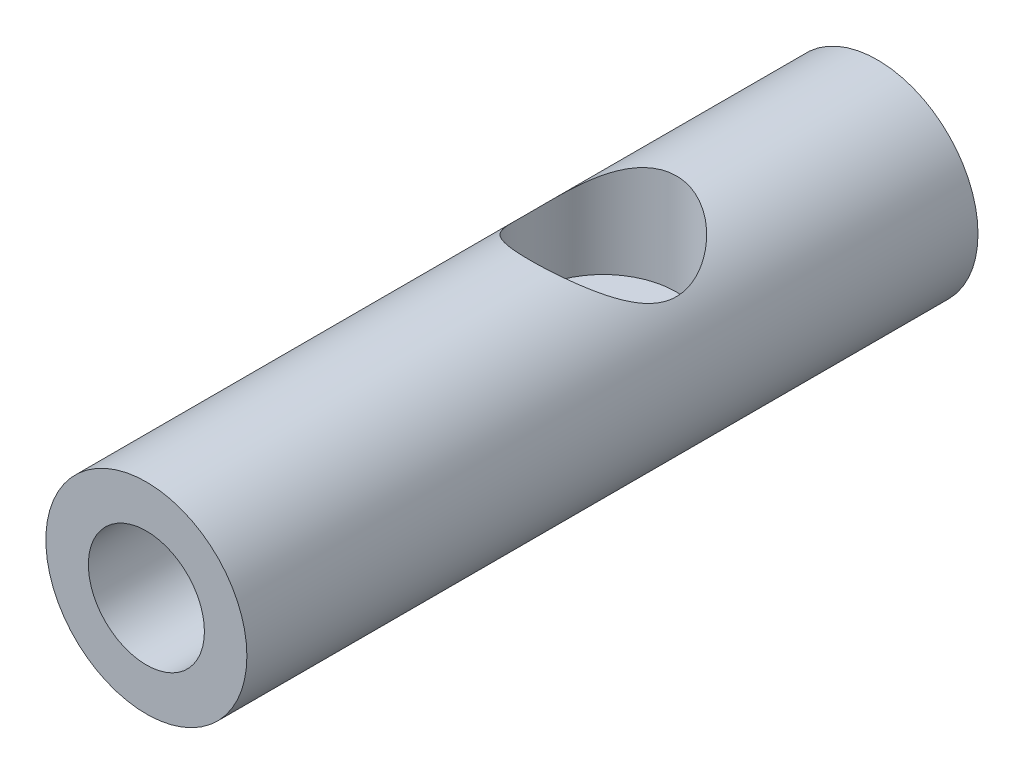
ISO-10303-21;
HEADER;
FILE_DESCRIPTION(('STEP AP214'),'2;1');
FILE_NAME('part.step','',(''),(''),'','','');
FILE_SCHEMA(('AUTOMOTIVE_DESIGN { 1 0 10303 214 1 1 1 1 }'));
ENDSEC;
DATA;
#1=APPLICATION_CONTEXT('core data for automotive mechanical design processes');
#2=APPLICATION_PROTOCOL_DEFINITION('international standard','automotive_design',2000,#1);
#3=PRODUCT_CONTEXT('',#1,'mechanical');
#4=PRODUCT('Part','Part','',(#3));
#5=PRODUCT_RELATED_PRODUCT_CATEGORY('part','',(#4));
#6=PRODUCT_DEFINITION_FORMATION('','',#4);
#7=PRODUCT_DEFINITION_CONTEXT('part definition',#1,'design');
#8=PRODUCT_DEFINITION('design','',#6,#7);
#9=PRODUCT_DEFINITION_SHAPE('','',#8);
#10=(LENGTH_UNIT() NAMED_UNIT(*) SI_UNIT(.MILLI.,.METRE.));
#11=(NAMED_UNIT(*) PLANE_ANGLE_UNIT() SI_UNIT($,.RADIAN.));
#12=(NAMED_UNIT(*) SI_UNIT($,.STERADIAN.) SOLID_ANGLE_UNIT());
#13=UNCERTAINTY_MEASURE_WITH_UNIT(LENGTH_MEASURE(1.E-05),#10,'distance_accuracy_value','');
#14=(GEOMETRIC_REPRESENTATION_CONTEXT(3) GLOBAL_UNCERTAINTY_ASSIGNED_CONTEXT((#13)) GLOBAL_UNIT_ASSIGNED_CONTEXT((#10,
#11,#12)) REPRESENTATION_CONTEXT('',''));
#15=CARTESIAN_POINT('',(0.,0.,0.));
#16=DIRECTION('',(0.,0.,1.));
#17=DIRECTION('',(1.,0.,0.));
#18=AXIS2_PLACEMENT_3D('',#15,#16,#17);
#19=CARTESIAN_POINT('',(0.,0.,20.));
#20=DIRECTION('',(0.,0.,-1.));
#21=DIRECTION('',(-1.,0.,0.));
#22=AXIS2_PLACEMENT_3D('',#19,#20,#21);
#23=CYLINDRICAL_SURFACE('',#22,5.5);
#24=CARTESIAN_POINT('',(0.,0.,20.));
#25=DIRECTION('',(0.,0.,1.));
#26=DIRECTION('',(1.,0.,0.));
#27=AXIS2_PLACEMENT_3D('',#24,#25,#26);
#28=CIRCLE('',#27,5.5);
#29=CARTESIAN_POINT('',(5.5,0.,20.));
#30=VERTEX_POINT('',#29);
#31=EDGE_CURVE('E42',#30,#30,#28,.T.);
#32=ORIENTED_EDGE('',*,*,#31,.F.);
#33=EDGE_LOOP('',(#32));
#34=FACE_BOUND('',#33,.T.);
#35=CARTESIAN_POINT('',(0.,0.,-20.));
#36=DIRECTION('',(0.,0.,1.));
#37=DIRECTION('',(1.,0.,0.));
#38=AXIS2_PLACEMENT_3D('',#35,#36,#37);
#39=CIRCLE('',#38,5.5);
#40=CARTESIAN_POINT('',(5.5,0.,-20.));
#41=VERTEX_POINT('',#40);
#42=EDGE_CURVE('E46',#41,#41,#39,.T.);
#43=ORIENTED_EDGE('',*,*,#42,.T.);
#44=EDGE_LOOP('',(#43));
#45=FACE_BOUND('',#44,.T.);
#46=CARTESIAN_POINT('',(0.,5.5,-9.));
#47=CARTESIAN_POINT('',(-0.098408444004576,5.49999903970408,-8.99999899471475));
#48=CARTESIAN_POINT('',(-0.196846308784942,5.49735205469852,-8.99636152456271));
#49=CARTESIAN_POINT('',(-0.392949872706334,5.48682476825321,-8.98186763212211));
#50=CARTESIAN_POINT('',(-0.490615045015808,5.47894116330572,-8.97100665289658));
#51=CARTESIAN_POINT('',(-0.684555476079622,5.45810479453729,-8.94220851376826));
#52=CARTESIAN_POINT('',(-0.780827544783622,5.44514186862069,-8.92425716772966));
#53=CARTESIAN_POINT('',(-0.971092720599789,5.41445183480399,-8.88155959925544));
#54=CARTESIAN_POINT('',(-1.0650847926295,5.39672260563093,-8.85681035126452));
#55=CARTESIAN_POINT('',(-1.34149727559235,5.33719436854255,-8.77322101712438));
#56=CARTESIAN_POINT('',(-1.51974308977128,5.28889729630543,-8.70482639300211));
#57=CARTESIAN_POINT('',(-1.86104833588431,5.17868357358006,-8.54570801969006));
#58=CARTESIAN_POINT('',(-2.02411279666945,5.11677145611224,-8.45499170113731));
#59=CARTESIAN_POINT('',(-2.34745196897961,4.97726899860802,-8.24498611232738));
#60=CARTESIAN_POINT('',(-2.50612448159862,4.89876490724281,-8.12384867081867));
#61=CARTESIAN_POINT('',(-2.80234464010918,4.735556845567,-7.86114554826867));
#62=CARTESIAN_POINT('',(-2.93985815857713,4.65084317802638,-7.71954756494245));
#63=CARTESIAN_POINT('',(-3.14142944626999,4.51549142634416,-7.47894022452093));
#64=CARTESIAN_POINT('',(-3.21271520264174,4.46491683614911,-7.38584323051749));
#65=CARTESIAN_POINT('',(-3.34716368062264,4.36503158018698,-7.1932384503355));
#66=CARTESIAN_POINT('',(-3.41032409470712,4.31572127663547,-7.09372885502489));
#67=CARTESIAN_POINT('',(-3.52805237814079,4.22002309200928,-6.8885986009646));
#68=CARTESIAN_POINT('',(-3.58263175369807,4.17363134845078,-6.78298638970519));
#69=CARTESIAN_POINT('',(-3.68277103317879,4.08554066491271,-6.56573311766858));
#70=CARTESIAN_POINT('',(-3.72833246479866,4.04384093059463,-6.45409308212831));
#71=CARTESIAN_POINT('',(-3.82361059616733,3.95419172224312,-6.18594942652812));
#72=CARTESIAN_POINT('',(-3.86948259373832,3.90893007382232,-6.02708689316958));
#73=CARTESIAN_POINT('',(-3.92354368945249,3.85440723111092,-5.78279639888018));
#74=CARTESIAN_POINT('',(-3.93910176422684,3.83846627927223,-5.70041335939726));
#75=CARTESIAN_POINT('',(-3.96508247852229,3.81162335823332,-5.53403852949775));
#76=CARTESIAN_POINT('',(-3.97550720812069,3.80071933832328,-5.45004740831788));
#77=CARTESIAN_POINT('',(-3.99107685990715,3.78436723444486,-5.28038994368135));
#78=CARTESIAN_POINT('',(-3.99618070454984,3.77896160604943,-5.19471569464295));
#79=CARTESIAN_POINT('',(-4.00085496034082,3.77401268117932,-5.02304696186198));
#80=CARTESIAN_POINT('',(-4.00042557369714,3.7744691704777,-4.93705248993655));
#81=CARTESIAN_POINT('',(-3.9940415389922,3.78122375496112,-4.7654654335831));
#82=CARTESIAN_POINT('',(-3.98808451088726,3.78752436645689,-4.67987303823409));
#83=CARTESIAN_POINT('',(-3.97077015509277,3.80567208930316,-4.50979837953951));
#84=CARTESIAN_POINT('',(-3.95941003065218,3.81752207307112,-4.42531671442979));
#85=CARTESIAN_POINT('',(-3.9299073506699,3.847898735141,-4.24849885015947));
#86=CARTESIAN_POINT('',(-3.91113665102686,3.86703500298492,-4.15637223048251));
#87=CARTESIAN_POINT('',(-3.86752833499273,3.91064916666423,-3.97483911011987));
#88=CARTESIAN_POINT('',(-3.84268664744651,3.93513064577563,-3.8854344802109));
#89=CARTESIAN_POINT('',(-3.75954096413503,4.01518937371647,-3.62164748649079));
#90=CARTESIAN_POINT('',(-3.69264874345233,4.07734524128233,-3.45187919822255));
#91=CARTESIAN_POINT('',(-3.5642123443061,4.18940076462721,-3.18040877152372));
#92=CARTESIAN_POINT('',(-3.50823146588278,4.23654386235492,-3.07478209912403));
#93=CARTESIAN_POINT('',(-3.38767435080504,4.33354849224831,-2.86979154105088));
#94=CARTESIAN_POINT('',(-3.32309579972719,4.38341075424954,-2.77042935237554));
#95=CARTESIAN_POINT('',(-3.18565928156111,4.48428947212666,-2.57810772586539));
#96=CARTESIAN_POINT('',(-3.11279435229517,4.53530686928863,-2.48515377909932));
#97=CARTESIAN_POINT('',(-2.95905843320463,4.63707579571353,-2.30594962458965));
#98=CARTESIAN_POINT('',(-2.87818712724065,4.68782731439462,-2.21969968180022));
#99=CARTESIAN_POINT('',(-2.70755212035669,4.78843347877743,-2.05321386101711));
#100=CARTESIAN_POINT('',(-2.61768838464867,4.83826850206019,-1.9730684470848));
#101=CARTESIAN_POINT('',(-2.43017835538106,4.93511583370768,-1.82056052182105));
#102=CARTESIAN_POINT('',(-2.33253311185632,4.98212852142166,-1.74819696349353));
#103=CARTESIAN_POINT('',(-2.12992764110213,5.07204693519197,-1.61204068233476));
#104=CARTESIAN_POINT('',(-2.02498109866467,5.11496000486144,-1.54823254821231));
#105=CARTESIAN_POINT('',(-1.8081616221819,5.19556941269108,-1.42987191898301));
#106=CARTESIAN_POINT('',(-1.69629131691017,5.23326771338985,-1.37531594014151));
#107=CARTESIAN_POINT('',(-1.4102171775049,5.31912327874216,-1.25221715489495));
#108=CARTESIAN_POINT('',(-1.2321446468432,5.36345823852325,-1.18976440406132));
#109=CARTESIAN_POINT('',(-0.865776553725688,5.43463079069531,-1.09021443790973));
#110=CARTESIAN_POINT('',(-0.677488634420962,5.46148127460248,-1.05309854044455));
#111=CARTESIAN_POINT('',(-0.295007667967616,5.4954458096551,-1.00623075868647));
#112=CARTESIAN_POINT('',(-0.100795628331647,5.50248769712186,-0.996578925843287));
#113=CARTESIAN_POINT('',(0.28662144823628,5.49594258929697,-1.00557956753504));
#114=CARTESIAN_POINT('',(0.479826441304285,5.48235470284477,-1.02423326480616));
#115=CARTESIAN_POINT('',(0.84845487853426,5.43715890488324,-1.08680099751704));
#116=CARTESIAN_POINT('',(1.02426702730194,5.40660857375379,-1.12923377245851));
#117=CARTESIAN_POINT('',(1.36562564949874,5.33063562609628,-1.23608136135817));
#118=CARTESIAN_POINT('',(1.53116998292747,5.28520992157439,-1.30050073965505));
#119=CARTESIAN_POINT('',(1.86254817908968,5.17819647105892,-1.45499135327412));
#120=CARTESIAN_POINT('',(2.02725211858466,5.11557595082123,-1.54675530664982));
#121=CARTESIAN_POINT('',(2.33947109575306,4.98054847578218,-1.75013135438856));
#122=CARTESIAN_POINT('',(2.48697454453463,4.90813499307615,-1.86175670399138));
#123=CARTESIAN_POINT('',(2.78904311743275,4.74403863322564,-2.12452792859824));
#124=CARTESIAN_POINT('',(2.9399691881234,4.65125321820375,-2.27916807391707));
#125=CARTESIAN_POINT('',(3.2152051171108,4.46542541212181,-2.61066271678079));
#126=CARTESIAN_POINT('',(3.33949353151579,4.37238287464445,-2.78753493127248));
#127=CARTESIAN_POINT('',(3.54628148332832,4.20586816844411,-3.13977727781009));
#128=CARTESIAN_POINT('',(3.63201008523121,4.13138834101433,-3.31276640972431));
#129=CARTESIAN_POINT('',(3.77892413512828,3.99745252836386,-3.67425257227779));
#130=CARTESIAN_POINT('',(3.84016090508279,3.93796522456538,-3.86271616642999));
#131=CARTESIAN_POINT('',(3.92447442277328,3.85373689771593,-4.21054640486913));
#132=CARTESIAN_POINT('',(3.95293016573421,3.82427115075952,-4.36743397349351));
#133=CARTESIAN_POINT('',(3.99085072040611,3.78469363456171,-4.68581080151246));
#134=CARTESIAN_POINT('',(4.00034270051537,3.77455417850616,-4.84729314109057));
#135=CARTESIAN_POINT('',(3.9996377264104,3.77530099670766,-5.17040511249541));
#136=CARTESIAN_POINT('',(3.98941138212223,3.786218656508,-5.33203460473));
#137=CARTESIAN_POINT('',(3.95001664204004,3.82728792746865,-5.65055529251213));
#138=CARTESIAN_POINT('',(3.92081835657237,3.85746988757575,-5.80743860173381));
#139=CARTESIAN_POINT('',(3.83369579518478,3.94430870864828,-6.15974890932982));
#140=CARTESIAN_POINT('',(3.76972865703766,4.00623096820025,-6.35235018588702));
#141=CARTESIAN_POINT('',(3.61630704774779,4.14523984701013,-6.72116198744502));
#142=CARTESIAN_POINT('',(3.5268095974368,4.2223519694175,-6.89734420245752));
#143=CARTESIAN_POINT('',(3.32181769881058,4.38556998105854,-7.23742741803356));
#144=CARTESIAN_POINT('',(3.20563731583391,4.47187341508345,-7.4008161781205));
#145=CARTESIAN_POINT('',(2.95012732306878,4.64440662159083,-7.70864188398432));
#146=CARTESIAN_POINT('',(2.81078817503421,4.73063634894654,-7.85307097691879));
#147=CARTESIAN_POINT('',(2.56887263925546,4.86434742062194,-8.06853788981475));
#148=CARTESIAN_POINT('',(2.47320695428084,4.91380339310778,-8.1462007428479));
#149=CARTESIAN_POINT('',(2.27388986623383,5.00915341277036,-8.29313709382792));
#150=CARTESIAN_POINT('',(2.17023667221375,5.05504665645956,-8.3624087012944));
#151=CARTESIAN_POINT('',(1.95549931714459,5.14192851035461,-8.49166326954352));
#152=CARTESIAN_POINT('',(1.84442265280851,5.18292195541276,-8.55165540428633));
#153=CARTESIAN_POINT('',(1.61540436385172,5.25880189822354,-8.66149903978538));
#154=CARTESIAN_POINT('',(1.49746635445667,5.29369157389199,-8.71135581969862));
#155=CARTESIAN_POINT('',(1.29007572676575,5.34730754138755,-8.78737372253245));
#156=CARTESIAN_POINT('',(1.20206275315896,5.36780854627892,-8.81624110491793));
#157=CARTESIAN_POINT('',(1.02345557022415,5.40470593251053,-8.86796791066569));
#158=CARTESIAN_POINT('',(0.932861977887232,5.42110328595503,-8.89082875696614));
#159=CARTESIAN_POINT('',(0.749865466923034,5.44942698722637,-8.93019600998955));
#160=CARTESIAN_POINT('',(0.65746776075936,5.46136464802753,-8.94671849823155));
#161=CARTESIAN_POINT('',(0.471295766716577,5.48056812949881,-8.97324948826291));
#162=CARTESIAN_POINT('',(0.377522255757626,5.48783649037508,-8.98326153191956));
#163=CARTESIAN_POINT('',(0.236296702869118,5.49512453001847,-8.9932941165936));
#164=CARTESIAN_POINT('',(0.189097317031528,5.49695146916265,-8.99580740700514));
#165=CARTESIAN_POINT('',(0.0946008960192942,5.4993895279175,-8.99916071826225));
#166=CARTESIAN_POINT('',(0.0473038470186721,5.50000046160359,-9.00000048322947));
#167=CARTESIAN_POINT('',(0.,5.5,-9.));
#168=B_SPLINE_CURVE_WITH_KNOTS('',3,(#46,#47,#48,#49,#50,#51,#52,#53,#54,#55,#56,#57,#58,#59,
#60,#61,#62,#63,#64,#65,#66,#67,#68,#69,#70,#71,#72,#73,#74,#75,#76,#77,#78,#79,#80,#81,#82,#83,
#84,#85,#86,#87,#88,#89,#90,#91,#92,#93,#94,#95,#96,#97,#98,#99,#100,#101,#102,#103,#104,#105,
#106,#107,#108,#109,#110,#111,#112,#113,#114,#115,#116,#117,#118,#119,#120,#121,#122,#123,#124,
#125,#126,#127,#128,#129,#130,#131,#132,#133,#134,#135,#136,#137,#138,#139,#140,#141,#142,#143,
#144,#145,#146,#147,#148,#149,#150,#151,#152,#153,#154,#155,#156,#157,#158,#159,#160,#161,#162,
#163,#164,#165,#166,#167),.UNSPECIFIED.,.T.,.F.,(4,2,2,2,2,2,2,2,2,2,2,2,2,2,2,2,2,2,2,2,2,2,2,
2,2,2,2,2,2,2,2,2,2,2,2,2,2,2,2,2,2,2,2,2,2,2,2,2,2,2,2,2,2,2,2,2,2,2,2,2,4),(0.,
0.295173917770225,0.590534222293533,0.886488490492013,1.18257469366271,1.77055979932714,
2.35834943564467,2.99959161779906,3.64185745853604,4.02458431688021,4.40741962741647,
4.78973713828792,5.1719898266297,5.68407429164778,5.9398376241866,6.19549673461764,
6.45311525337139,6.71072435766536,6.96844443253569,7.22629805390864,7.51370613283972,
7.80130747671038,8.37708279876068,8.76220665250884,9.14743438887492,9.53298821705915,
9.91855727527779,10.3090312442,10.6994526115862,11.0891609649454,11.4787222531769,
12.0576277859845,12.6361059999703,13.2166889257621,13.7972969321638,14.3452171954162,
14.8932512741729,15.4870438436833,16.0812341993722,16.7840549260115,17.4874393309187,
18.1061725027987,18.7236022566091,19.2080094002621,19.6917220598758,20.1761562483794,
20.6613555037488,21.2944341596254,21.9285849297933,22.5813485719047,23.2343817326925,
23.6322360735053,24.0301798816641,24.4277277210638,24.8250679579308,25.1093874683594,
25.3936395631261,25.6771656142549,25.9605372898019,26.1024024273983,26.244289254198),.UNSPECIFIED.);
#169=CARTESIAN_POINT('',(0.,5.5,-9.));
#170=VERTEX_POINT('',#169);
#171=EDGE_CURVE('E10',#170,#170,#168,.T.);
#172=ORIENTED_EDGE('',*,*,#171,.F.);
#173=EDGE_LOOP('',(#172));
#174=FACE_BOUND('',#173,.T.);
#175=ADVANCED_FACE('F31',(#34,#45,#174),#23,.T.);
#176=CARTESIAN_POINT('',(0.,0.,20.));
#177=DIRECTION('',(0.,0.,1.));
#178=DIRECTION('',(1.,0.,0.));
#179=AXIS2_PLACEMENT_3D('',#176,#177,#178);
#180=PLANE('',#179);
#181=CARTESIAN_POINT('',(0.,0.,20.));
#182=DIRECTION('',(0.,0.,1.));
#183=DIRECTION('',(1.,0.,0.));
#184=AXIS2_PLACEMENT_3D('',#181,#182,#183);
#185=CIRCLE('',#184,3.175);
#186=CARTESIAN_POINT('',(3.175,0.,20.));
#187=VERTEX_POINT('',#186);
#188=EDGE_CURVE('E56',#187,#187,#185,.T.);
#189=ORIENTED_EDGE('',*,*,#188,.F.);
#190=EDGE_LOOP('',(#189));
#191=FACE_BOUND('',#190,.T.);
#192=ORIENTED_EDGE('',*,*,#31,.T.);
#193=EDGE_LOOP('',(#192));
#194=FACE_BOUND('',#193,.T.);
#195=ADVANCED_FACE('F81',(#191,#194),#180,.T.);
#196=CARTESIAN_POINT('',(0.,0.,-20.));
#197=DIRECTION('',(0.,0.,1.));
#198=DIRECTION('',(1.,0.,0.));
#199=AXIS2_PLACEMENT_3D('',#196,#197,#198);
#200=PLANE('',#199);
#201=CARTESIAN_POINT('',(0.,0.,-20.));
#202=DIRECTION('',(0.,0.,-1.));
#203=DIRECTION('',(-1.,0.,0.));
#204=AXIS2_PLACEMENT_3D('',#201,#202,#203);
#205=CIRCLE('',#204,3.2);
#206=CARTESIAN_POINT('',(-3.2,0.,-20.));
#207=VERTEX_POINT('',#206);
#208=EDGE_CURVE('E62',#207,#207,#205,.T.);
#209=ORIENTED_EDGE('',*,*,#208,.F.);
#210=EDGE_LOOP('',(#209));
#211=FACE_BOUND('',#210,.T.);
#212=ORIENTED_EDGE('',*,*,#42,.F.);
#213=EDGE_LOOP('',(#212));
#214=FACE_BOUND('',#213,.T.);
#215=ADVANCED_FACE('F77',(#211,#214),#200,.F.);
#216=CARTESIAN_POINT('',(0.,5.5,-5.));
#217=DIRECTION('',(0.,-1.,0.));
#218=DIRECTION('',(0.,0.,-1.));
#219=AXIS2_PLACEMENT_3D('',#216,#217,#218);
#220=CYLINDRICAL_SURFACE('',#219,4.);
#221=CARTESIAN_POINT('',(0.,0.,-5.));
#222=DIRECTION('',(0.,1.,0.));
#223=DIRECTION('',(0.,0.,1.));
#224=AXIS2_PLACEMENT_3D('',#221,#222,#223);
#225=CIRCLE('',#224,4.);
#226=CARTESIAN_POINT('',(0.,0.,-1.));
#227=VERTEX_POINT('',#226);
#228=EDGE_CURVE('E51',#227,#227,#225,.T.);
#229=ORIENTED_EDGE('',*,*,#228,.F.);
#230=EDGE_LOOP('',(#229));
#231=FACE_BOUND('',#230,.T.);
#232=ORIENTED_EDGE('',*,*,#171,.T.);
#233=EDGE_LOOP('',(#232));
#234=FACE_BOUND('',#233,.T.);
#235=ADVANCED_FACE('F80',(#231,#234),#220,.F.);
#236=CARTESIAN_POINT('',(0.,0.,-5.));
#237=DIRECTION('',(0.,1.,0.));
#238=DIRECTION('',(0.,0.,1.));
#239=AXIS2_PLACEMENT_3D('',#236,#237,#238);
#240=PLANE('',#239);
#241=ORIENTED_EDGE('',*,*,#228,.T.);
#242=EDGE_LOOP('',(#241));
#243=FACE_BOUND('',#242,.T.);
#244=ADVANCED_FACE('F98',(#243),#240,.T.);
#245=CARTESIAN_POINT('',(0.,0.,14.3));
#246=DIRECTION('',(0.,0.,1.));
#247=DIRECTION('',(1.,0.,0.));
#248=AXIS2_PLACEMENT_3D('',#245,#246,#247);
#249=CYLINDRICAL_SURFACE('',#248,3.175);
#250=CARTESIAN_POINT('',(0.,0.,14.3));
#251=DIRECTION('',(0.,0.,1.));
#252=DIRECTION('',(1.,0.,0.));
#253=AXIS2_PLACEMENT_3D('',#250,#251,#252);
#254=CIRCLE('',#253,3.175);
#255=CARTESIAN_POINT('',(3.175,0.,14.3));
#256=VERTEX_POINT('',#255);
#257=EDGE_CURVE('E55',#256,#256,#254,.T.);
#258=ORIENTED_EDGE('',*,*,#257,.F.);
#259=EDGE_LOOP('',(#258));
#260=FACE_BOUND('',#259,.T.);
#261=ORIENTED_EDGE('',*,*,#188,.T.);
#262=EDGE_LOOP('',(#261));
#263=FACE_BOUND('',#262,.T.);
#264=ADVANCED_FACE('F102',(#260,#263),#249,.F.);
#265=CARTESIAN_POINT('',(0.,0.,14.3));
#266=DIRECTION('',(0.,0.,1.));
#267=DIRECTION('',(1.,0.,0.));
#268=AXIS2_PLACEMENT_3D('',#265,#266,#267);
#269=PLANE('',#268);
#270=ORIENTED_EDGE('',*,*,#257,.T.);
#271=EDGE_LOOP('',(#270));
#272=FACE_BOUND('',#271,.T.);
#273=ADVANCED_FACE('F73',(#272),#269,.T.);
#274=CARTESIAN_POINT('',(0.,0.,-17.));
#275=DIRECTION('',(0.,0.,-1.));
#276=DIRECTION('',(-1.,0.,0.));
#277=AXIS2_PLACEMENT_3D('',#274,#275,#276);
#278=CYLINDRICAL_SURFACE('',#277,3.2);
#279=CARTESIAN_POINT('',(0.,0.,-17.));
#280=DIRECTION('',(0.,0.,-1.));
#281=DIRECTION('',(-1.,0.,0.));
#282=AXIS2_PLACEMENT_3D('',#279,#280,#281);
#283=CIRCLE('',#282,3.2);
#284=CARTESIAN_POINT('',(-3.2,0.,-17.));
#285=VERTEX_POINT('',#284);
#286=EDGE_CURVE('E59',#285,#285,#283,.T.);
#287=ORIENTED_EDGE('',*,*,#286,.F.);
#288=EDGE_LOOP('',(#287));
#289=FACE_BOUND('',#288,.T.);
#290=ORIENTED_EDGE('',*,*,#208,.T.);
#291=EDGE_LOOP('',(#290));
#292=FACE_BOUND('',#291,.T.);
#293=ADVANCED_FACE('F70',(#289,#292),#278,.F.);
#294=CARTESIAN_POINT('',(0.,0.,-17.));
#295=DIRECTION('',(0.,0.,-1.));
#296=DIRECTION('',(-1.,0.,0.));
#297=AXIS2_PLACEMENT_3D('',#294,#295,#296);
#298=PLANE('',#297);
#299=ORIENTED_EDGE('',*,*,#286,.T.);
#300=EDGE_LOOP('',(#299));
#301=FACE_BOUND('',#300,.T.);
#302=ADVANCED_FACE('F68',(#301),#298,.T.);
#303=CLOSED_SHELL('',(#175,#195,#215,#235,#244,#264,#273,#293,#302));
#304=MANIFOLD_SOLID_BREP('B2',#303);
#305=ADVANCED_BREP_SHAPE_REPRESENTATION('',(#18,#304),#14);
#306=SHAPE_DEFINITION_REPRESENTATION(#9,#305);
ENDSEC;
END-ISO-10303-21;
